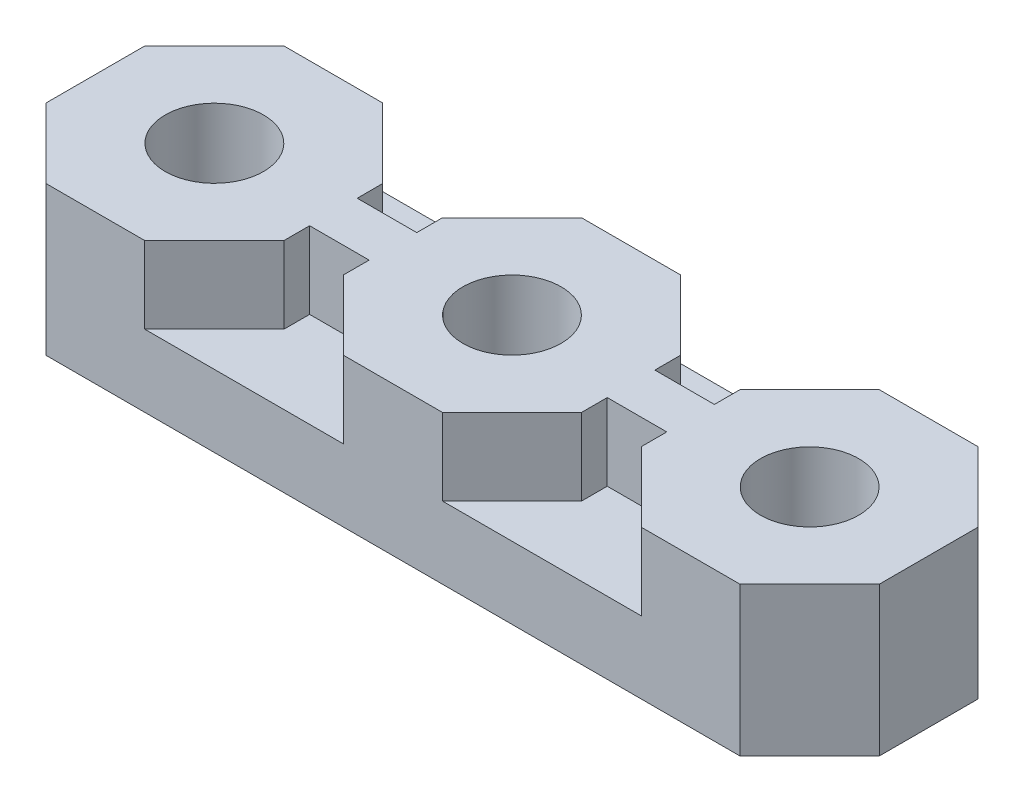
from build123d import *

# Parameters (mm, degrees)
SKETCH1_W           = 35.56
SKETCH1_H           = 10.16
BOSS_EXTRUDE1_DEPTH = 6.35
SKETCH2_R           = 2.0955
CUT_EXTRUDE1_DEPTH  = 20.551401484
CUT_EXTRUDE2_DEPTH  = 3.2766
CUT_EXTRUDE3_DEPTH  = 20.551401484
SKETCH3_W           = 8.128
SKETCH3_H           = 7.112
CUT_EXTRUDE4_DEPTH  = 2.0066


with BuildPart() as part:
    # Sketch1 → Boss-Extrude1 (new body)
    with BuildSketch(Plane(origin=(0, 0, 0), x_dir=(1, 0, 0), z_dir=(0, 1, 0))):
        Rectangle(SKETCH1_W, SKETCH1_H)
    extrude(amount=BOSS_EXTRUDE1_DEPTH)

    # Sketch2 → Cut-Extrude1 (cut, through all)
    with BuildSketch(Plane(origin=(0, 6.35, 0), x_dir=(1, 0, 0), z_dir=(0, 1, 0))):
        with Locations(Location((-12.7, 0, 0), (0, 0, 270))):
            Circle(SKETCH2_R)
        with Locations(Location((0, 0, 0), (0, 0, 270))):
            Circle(SKETCH2_R)
        with Locations(Location((12.7, 0, 0), (0, 0, 270))):
            Circle(SKETCH2_R)
    extrude(amount=-CUT_EXTRUDE1_DEPTH, mode=Mode.SUBTRACT)

    # Sketch2_3 → Cut-Extrude2 (cut)
    with BuildSketch(Plane(origin=(0, 6.35, 0), x_dir=(1, 0, 0), z_dir=(0, 1, 0))):
        Polygon((-5.08, 2.104204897), (-2.104204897, 5.08), (-10.595795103, 5.08), (-7.62, 2.104204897), (-7.62, 1.016), (-5.08, 1.016), align=None)
        Polygon((-5.08, -2.104204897), (-5.08, -1.016), (-7.62, -1.016), (-7.62, -2.104204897), (-10.595795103, -5.08), (-2.104204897, -5.08), align=None)
        Polygon((7.62, -1.016), (5.08, -1.016), (5.08, -2.104204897), (2.104204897, -5.08), (10.595795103, -5.08), (7.62, -2.104204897), align=None)
        Polygon((10.595795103, 5.08), (2.104204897, 5.08), (5.08, 2.104204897), (5.08, 1.016), (7.62, 1.016), (7.62, 2.104204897), align=None)
    extrude(amount=-CUT_EXTRUDE2_DEPTH, mode=Mode.SUBTRACT)

    # Sketch2_4 → Cut-Extrude3 (cut, through all)
    with BuildSketch(Plane(origin=(0, 6.35, 0), x_dir=(1, 0, 0), z_dir=(0, 1, 0))):
        Polygon((-17.78, 2.104204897), (-14.804204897, 5.08), (-17.78, 5.08), align=None)
        Polygon((-14.804204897, -5.08), (-17.78, -2.104204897), (-17.78, -5.08), align=None)
        Polygon((17.78, -5.08), (17.78, -2.104204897), (14.804204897, -5.08), align=None)
        Polygon((17.78, 5.08), (14.804204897, 5.08), (17.78, 2.104204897), align=None)
    extrude(amount=-CUT_EXTRUDE3_DEPTH, mode=Mode.SUBTRACT)

    # Sketch3 → Cut-Extrude4 (cut)
    with BuildSketch(Plane.XZ):
        with Locations((-6.299932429, 0)):
            Rectangle(SKETCH3_W, SKETCH3_H)
        with Locations((6.299932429, 0)):
            Rectangle(SKETCH3_W, SKETCH3_H)
    extrude(amount=-CUT_EXTRUDE4_DEPTH, mode=Mode.SUBTRACT)


solid = part.part
